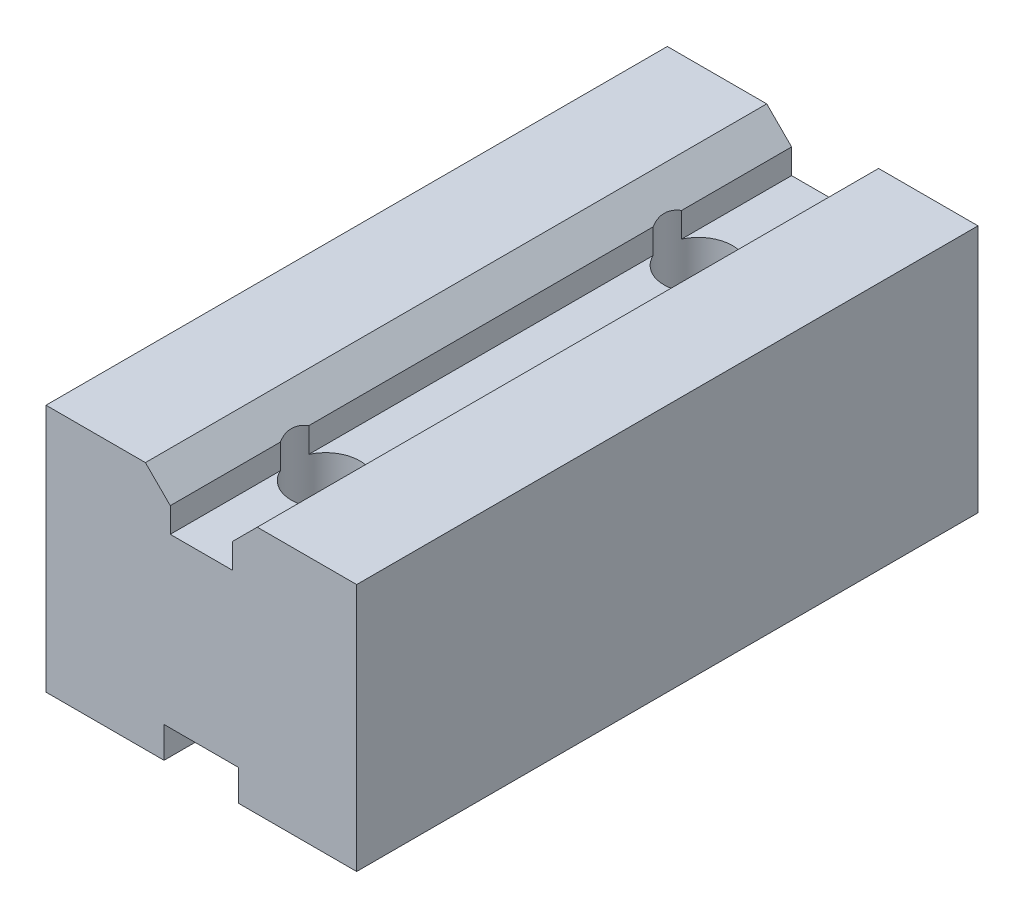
from build123d import *

# Parameters (mm, degrees)
AUFSATZ_LINEAR_AUSTRAGEN1_DEPTH                      = 25
SKIZZE2_W                                            = 6
SKIZZE2_H                                            = 2.5
SCHNITT_LINEAR_AUSTRAGEN1_DEPTH                      = 56.283360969
STIRNSENKUNG_F_R_M2_5_ZYLINDERSCHRAUBE_M_D           = 2.9
STIRNSENKUNG_F_R_M2_5_ZYLINDERSCHRAUBE_M_CBORE_D     = 5.5
STIRNSENKUNG_F_R_M2_5_ZYLINDERSCHRAUBE_M_CBORE_DEPTH = 10


with BuildPart() as part:
    # Skizze1 → Aufsatz-Linear austragen1 (new, symmetric)
    with BuildSketch(Plane.XY):
        Polygon((12.5, 0), (-12.5, 0), (-12.5, 20), (-4.5, 20), (-2.5, 18), (-2.5, 16), (2.5, 16), (2.5, 18), (4.5, 20), (12.5, 20), align=None)
    extrude(amount=AUFSATZ_LINEAR_AUSTRAGEN1_DEPTH, both=True)

    # Skizze2 → Schnitt-Linear austragen1 (cut, through all)
    with BuildSketch(Plane.XY.offset(25)):
        with Locations((0, 1.25)):
            Rectangle(SKIZZE2_W, SKIZZE2_H)
    extrude(amount=-SCHNITT_LINEAR_AUSTRAGEN1_DEPTH, mode=Mode.SUBTRACT)

    # Stirnsenkung f_r M2.5 Zylinderschraube m (through all)
    with Locations(Plane(origin=(0, 20, 0), x_dir=(-1, 0, 0), z_dir=(0, 1, 0))):
        with Locations((0, -15)):
            stirnsenkung_f_r_m2_5_zylinderschraube_m = CounterBoreHole(STIRNSENKUNG_F_R_M2_5_ZYLINDERSCHRAUBE_M_D / 2, STIRNSENKUNG_F_R_M2_5_ZYLINDERSCHRAUBE_M_CBORE_D / 2, STIRNSENKUNG_F_R_M2_5_ZYLINDERSCHRAUBE_M_CBORE_DEPTH)

    # Spiegeln1: Stirnsenkung f_r M2.5 Zylinderschraube m across plane
    add(stirnsenkung_f_r_m2_5_zylinderschraube_m.mirror(Plane.XY), mode=Mode.SUBTRACT)


solid = part.part
